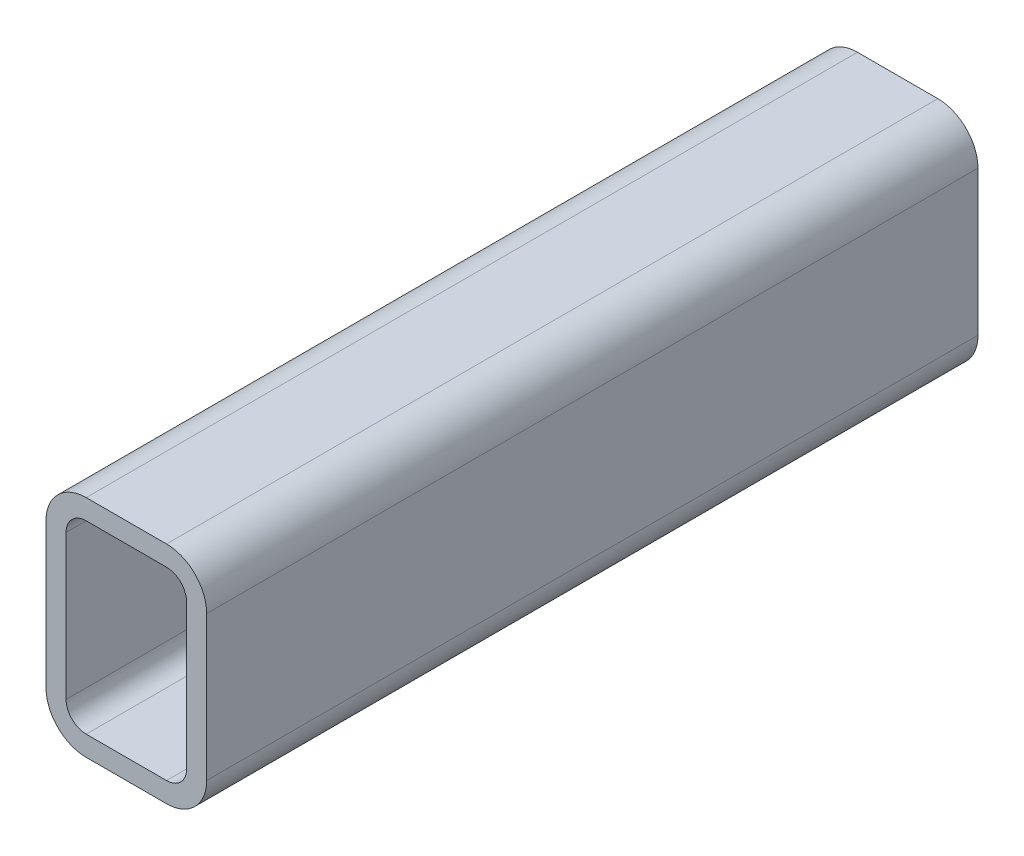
ISO-10303-21;
HEADER;
FILE_DESCRIPTION(('STEP AP214'),'2;1');
FILE_NAME('part.step','',(''),(''),'','','');
FILE_SCHEMA(('AUTOMOTIVE_DESIGN { 1 0 10303 214 1 1 1 1 }'));
ENDSEC;
DATA;
#1=APPLICATION_CONTEXT('core data for automotive mechanical design processes');
#2=APPLICATION_PROTOCOL_DEFINITION('international standard','automotive_design',2000,#1);
#3=PRODUCT_CONTEXT('',#1,'mechanical');
#4=PRODUCT('Part','Part','',(#3));
#5=PRODUCT_RELATED_PRODUCT_CATEGORY('part','',(#4));
#6=PRODUCT_DEFINITION_FORMATION('','',#4);
#7=PRODUCT_DEFINITION_CONTEXT('part definition',#1,'design');
#8=PRODUCT_DEFINITION('design','',#6,#7);
#9=PRODUCT_DEFINITION_SHAPE('','',#8);
#10=(LENGTH_UNIT() NAMED_UNIT(*) SI_UNIT(.MILLI.,.METRE.));
#11=(NAMED_UNIT(*) PLANE_ANGLE_UNIT() SI_UNIT($,.RADIAN.));
#12=(NAMED_UNIT(*) SI_UNIT($,.STERADIAN.) SOLID_ANGLE_UNIT());
#13=UNCERTAINTY_MEASURE_WITH_UNIT(LENGTH_MEASURE(1.E-05),#10,'distance_accuracy_value','');
#14=(GEOMETRIC_REPRESENTATION_CONTEXT(3) GLOBAL_UNCERTAINTY_ASSIGNED_CONTEXT((#13)) GLOBAL_UNIT_ASSIGNED_CONTEXT((#10,
#11,#12)) REPRESENTATION_CONTEXT('',''));
#15=CARTESIAN_POINT('',(0.,0.,0.));
#16=DIRECTION('',(0.,0.,1.));
#17=DIRECTION('',(1.,0.,0.));
#18=AXIS2_PLACEMENT_3D('',#15,#16,#17);
#19=CARTESIAN_POINT('',(18.7710851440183,73.8265103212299,304.8));
#20=DIRECTION('',(0.,0.,1.));
#21=DIRECTION('',(1.,0.,0.));
#22=AXIS2_PLACEMENT_3D('',#19,#20,#21);
#23=PLANE('',#22);
#24=CARTESIAN_POINT('',(18.7710851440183,73.8265103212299,304.8));
#25=DIRECTION('',(0.,0.,1.));
#26=DIRECTION('',(1.,0.,0.));
#27=AXIS2_PLACEMENT_3D('',#24,#25,#26);
#28=CIRCLE('',#27,15.875);
#29=CARTESIAN_POINT('',(18.7710851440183,89.7015103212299,304.8));
#30=VERTEX_POINT('',#29);
#31=CARTESIAN_POINT('',(2.89608514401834,73.8265103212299,304.8));
#32=VERTEX_POINT('',#31);
#33=EDGE_CURVE('E211',#30,#32,#28,.T.);
#34=ORIENTED_EDGE('',*,*,#33,.T.);
#35=DIRECTION('',(0.,-1.,0.));
#36=VECTOR('',#35,1.);
#37=CARTESIAN_POINT('',(2.89608514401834,16.6765103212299,304.8));
#38=LINE('',#37,#36);
#39=CARTESIAN_POINT('',(2.89608514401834,16.6765103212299,304.8));
#40=VERTEX_POINT('',#39);
#41=EDGE_CURVE('E214',#32,#40,#38,.T.);
#42=ORIENTED_EDGE('',*,*,#41,.T.);
#43=CARTESIAN_POINT('',(18.7710851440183,16.6765103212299,304.8));
#44=DIRECTION('',(0.,0.,1.));
#45=DIRECTION('',(1.,0.,0.));
#46=AXIS2_PLACEMENT_3D('',#43,#44,#45);
#47=CIRCLE('',#46,15.875);
#48=CARTESIAN_POINT('',(18.7710851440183,0.801510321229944,304.8));
#49=VERTEX_POINT('',#48);
#50=EDGE_CURVE('E217',#40,#49,#47,.T.);
#51=ORIENTED_EDGE('',*,*,#50,.T.);
#52=DIRECTION('',(1.,0.,0.));
#53=VECTOR('',#52,1.);
#54=CARTESIAN_POINT('',(50.5210851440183,0.801510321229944,304.8));
#55=LINE('',#54,#53);
#56=CARTESIAN_POINT('',(50.5210851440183,0.80151032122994,304.8));
#57=VERTEX_POINT('',#56);
#58=EDGE_CURVE('E219',#49,#57,#55,.T.);
#59=ORIENTED_EDGE('',*,*,#58,.T.);
#60=CARTESIAN_POINT('',(50.5210851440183,16.6765103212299,304.8));
#61=DIRECTION('',(0.,0.,1.));
#62=DIRECTION('',(1.,0.,0.));
#63=AXIS2_PLACEMENT_3D('',#60,#61,#62);
#64=CIRCLE('',#63,15.875);
#65=CARTESIAN_POINT('',(66.3960851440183,16.6765103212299,304.8));
#66=VERTEX_POINT('',#65);
#67=EDGE_CURVE('E221',#57,#66,#64,.T.);
#68=ORIENTED_EDGE('',*,*,#67,.T.);
#69=DIRECTION('',(0.,1.,0.));
#70=VECTOR('',#69,1.);
#71=CARTESIAN_POINT('',(66.3960851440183,73.8265103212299,304.8));
#72=LINE('',#71,#70);
#73=CARTESIAN_POINT('',(66.3960851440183,73.8265103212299,304.8));
#74=VERTEX_POINT('',#73);
#75=EDGE_CURVE('E223',#66,#74,#72,.T.);
#76=ORIENTED_EDGE('',*,*,#75,.T.);
#77=CARTESIAN_POINT('',(50.5210851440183,73.8265103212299,304.8));
#78=DIRECTION('',(0.,0.,1.));
#79=DIRECTION('',(1.,0.,0.));
#80=AXIS2_PLACEMENT_3D('',#77,#78,#79);
#81=CIRCLE('',#80,15.875);
#82=CARTESIAN_POINT('',(50.5210851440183,89.7015103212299,304.8));
#83=VERTEX_POINT('',#82);
#84=EDGE_CURVE('E225',#74,#83,#81,.T.);
#85=ORIENTED_EDGE('',*,*,#84,.T.);
#86=DIRECTION('',(-1.,0.,0.));
#87=VECTOR('',#86,1.);
#88=CARTESIAN_POINT('',(18.7710851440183,89.7015103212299,304.8));
#89=LINE('',#88,#87);
#90=EDGE_CURVE('E227',#83,#30,#89,.T.);
#91=ORIENTED_EDGE('',*,*,#90,.T.);
#92=EDGE_LOOP('',(#34,#42,#51,#59,#68,#76,#85,#91));
#93=FACE_BOUND('',#92,.T.);
#94=DIRECTION('',(0.,-1.,0.));
#95=VECTOR('',#94,1.);
#96=CARTESIAN_POINT('',(10.8335851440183,16.6765103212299,304.8));
#97=LINE('',#96,#95);
#98=CARTESIAN_POINT('',(10.8335851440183,73.8265103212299,304.8));
#99=VERTEX_POINT('',#98);
#100=CARTESIAN_POINT('',(10.8335851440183,16.6765103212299,304.8));
#101=VERTEX_POINT('',#100);
#102=EDGE_CURVE('E154',#99,#101,#97,.T.);
#103=ORIENTED_EDGE('',*,*,#102,.F.);
#104=CARTESIAN_POINT('',(18.7710851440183,73.8265103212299,304.8));
#105=DIRECTION('',(0.,0.,1.));
#106=DIRECTION('',(1.,0.,0.));
#107=AXIS2_PLACEMENT_3D('',#104,#105,#106);
#108=CIRCLE('',#107,7.9375);
#109=CARTESIAN_POINT('',(18.7710851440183,81.7640103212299,304.8));
#110=VERTEX_POINT('',#109);
#111=EDGE_CURVE('E146',#110,#99,#108,.T.);
#112=ORIENTED_EDGE('',*,*,#111,.F.);
#113=DIRECTION('',(-1.,0.,0.));
#114=VECTOR('',#113,1.);
#115=CARTESIAN_POINT('',(18.7710851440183,81.7640103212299,304.8));
#116=LINE('',#115,#114);
#117=CARTESIAN_POINT('',(50.5210851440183,81.7640103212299,304.8));
#118=VERTEX_POINT('',#117);
#119=EDGE_CURVE('E179',#118,#110,#116,.T.);
#120=ORIENTED_EDGE('',*,*,#119,.F.);
#121=CARTESIAN_POINT('',(50.5210851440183,73.8265103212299,304.8));
#122=DIRECTION('',(0.,0.,1.));
#123=DIRECTION('',(1.,0.,0.));
#124=AXIS2_PLACEMENT_3D('',#121,#122,#123);
#125=CIRCLE('',#124,7.9375);
#126=CARTESIAN_POINT('',(58.4585851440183,73.8265103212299,304.8));
#127=VERTEX_POINT('',#126);
#128=EDGE_CURVE('E177',#127,#118,#125,.T.);
#129=ORIENTED_EDGE('',*,*,#128,.F.);
#130=DIRECTION('',(0.,1.,0.));
#131=VECTOR('',#130,1.);
#132=CARTESIAN_POINT('',(58.4585851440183,73.8265103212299,304.8));
#133=LINE('',#132,#131);
#134=CARTESIAN_POINT('',(58.4585851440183,16.6765103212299,304.8));
#135=VERTEX_POINT('',#134);
#136=EDGE_CURVE('E175',#135,#127,#133,.T.);
#137=ORIENTED_EDGE('',*,*,#136,.F.);
#138=CARTESIAN_POINT('',(50.5210851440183,16.6765103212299,304.8));
#139=DIRECTION('',(0.,0.,1.));
#140=DIRECTION('',(1.,0.,0.));
#141=AXIS2_PLACEMENT_3D('',#138,#139,#140);
#142=CIRCLE('',#141,7.93750000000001);
#143=CARTESIAN_POINT('',(50.5210851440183,8.73901032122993,304.8));
#144=VERTEX_POINT('',#143);
#145=EDGE_CURVE('E173',#144,#135,#142,.T.);
#146=ORIENTED_EDGE('',*,*,#145,.F.);
#147=DIRECTION('',(1.,0.,0.));
#148=VECTOR('',#147,1.);
#149=CARTESIAN_POINT('',(50.5210851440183,8.73901032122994,304.8));
#150=LINE('',#149,#148);
#151=CARTESIAN_POINT('',(18.7710851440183,8.73901032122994,304.8));
#152=VERTEX_POINT('',#151);
#153=EDGE_CURVE('E169',#152,#144,#150,.T.);
#154=ORIENTED_EDGE('',*,*,#153,.F.);
#155=CARTESIAN_POINT('',(18.7710851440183,16.6765103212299,304.8));
#156=DIRECTION('',(0.,0.,1.));
#157=DIRECTION('',(1.,0.,0.));
#158=AXIS2_PLACEMENT_3D('',#155,#156,#157);
#159=CIRCLE('',#158,7.9375);
#160=EDGE_CURVE('E167',#101,#152,#159,.T.);
#161=ORIENTED_EDGE('',*,*,#160,.F.);
#162=EDGE_LOOP('',(#103,#112,#120,#129,#137,#146,#154,#161));
#163=FACE_BOUND('',#162,.T.);
#164=ADVANCED_FACE('F33',(#93,#163),#23,.T.);
#165=CARTESIAN_POINT('',(18.7710851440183,73.8265103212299,0.));
#166=DIRECTION('',(0.,0.,1.));
#167=DIRECTION('',(1.,0.,0.));
#168=AXIS2_PLACEMENT_3D('',#165,#166,#167);
#169=PLANE('',#168);
#170=CARTESIAN_POINT('',(18.7710851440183,73.8265103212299,0.));
#171=DIRECTION('',(0.,0.,1.));
#172=DIRECTION('',(1.,0.,0.));
#173=AXIS2_PLACEMENT_3D('',#170,#171,#172);
#174=CIRCLE('',#173,15.875);
#175=CARTESIAN_POINT('',(18.7710851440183,89.7015103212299,0.));
#176=VERTEX_POINT('',#175);
#177=CARTESIAN_POINT('',(2.89608514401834,73.8265103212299,0.));
#178=VERTEX_POINT('',#177);
#179=EDGE_CURVE('E162',#176,#178,#174,.T.);
#180=ORIENTED_EDGE('',*,*,#179,.F.);
#181=DIRECTION('',(-1.,0.,0.));
#182=VECTOR('',#181,1.);
#183=CARTESIAN_POINT('',(18.7710851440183,89.7015103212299,0.));
#184=LINE('',#183,#182);
#185=CARTESIAN_POINT('',(50.5210851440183,89.7015103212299,0.));
#186=VERTEX_POINT('',#185);
#187=EDGE_CURVE('E215',#186,#176,#184,.T.);
#188=ORIENTED_EDGE('',*,*,#187,.F.);
#189=CARTESIAN_POINT('',(50.5210851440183,73.8265103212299,0.));
#190=DIRECTION('',(0.,0.,1.));
#191=DIRECTION('',(1.,0.,0.));
#192=AXIS2_PLACEMENT_3D('',#189,#190,#191);
#193=CIRCLE('',#192,15.875);
#194=CARTESIAN_POINT('',(66.3960851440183,73.8265103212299,0.));
#195=VERTEX_POINT('',#194);
#196=EDGE_CURVE('E242',#195,#186,#193,.T.);
#197=ORIENTED_EDGE('',*,*,#196,.F.);
#198=DIRECTION('',(0.,1.,0.));
#199=VECTOR('',#198,1.);
#200=CARTESIAN_POINT('',(66.3960851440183,73.8265103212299,0.));
#201=LINE('',#200,#199);
#202=CARTESIAN_POINT('',(66.3960851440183,16.6765103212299,0.));
#203=VERTEX_POINT('',#202);
#204=EDGE_CURVE('E240',#203,#195,#201,.T.);
#205=ORIENTED_EDGE('',*,*,#204,.F.);
#206=CARTESIAN_POINT('',(50.5210851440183,16.6765103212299,0.));
#207=DIRECTION('',(0.,0.,1.));
#208=DIRECTION('',(1.,0.,0.));
#209=AXIS2_PLACEMENT_3D('',#206,#207,#208);
#210=CIRCLE('',#209,15.875);
#211=CARTESIAN_POINT('',(50.5210851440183,0.80151032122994,0.));
#212=VERTEX_POINT('',#211);
#213=EDGE_CURVE('E238',#212,#203,#210,.T.);
#214=ORIENTED_EDGE('',*,*,#213,.F.);
#215=DIRECTION('',(1.,0.,0.));
#216=VECTOR('',#215,1.);
#217=CARTESIAN_POINT('',(50.5210851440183,0.801510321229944,0.));
#218=LINE('',#217,#216);
#219=CARTESIAN_POINT('',(18.7710851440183,0.801510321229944,0.));
#220=VERTEX_POINT('',#219);
#221=EDGE_CURVE('E236',#220,#212,#218,.T.);
#222=ORIENTED_EDGE('',*,*,#221,.F.);
#223=CARTESIAN_POINT('',(18.7710851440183,16.6765103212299,0.));
#224=DIRECTION('',(0.,0.,1.));
#225=DIRECTION('',(1.,0.,0.));
#226=AXIS2_PLACEMENT_3D('',#223,#224,#225);
#227=CIRCLE('',#226,15.875);
#228=CARTESIAN_POINT('',(2.89608514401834,16.6765103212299,0.));
#229=VERTEX_POINT('',#228);
#230=EDGE_CURVE('E234',#229,#220,#227,.T.);
#231=ORIENTED_EDGE('',*,*,#230,.F.);
#232=DIRECTION('',(0.,-1.,0.));
#233=VECTOR('',#232,1.);
#234=CARTESIAN_POINT('',(2.89608514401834,16.6765103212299,0.));
#235=LINE('',#234,#233);
#236=EDGE_CURVE('E232',#178,#229,#235,.T.);
#237=ORIENTED_EDGE('',*,*,#236,.F.);
#238=EDGE_LOOP('',(#180,#188,#197,#205,#214,#222,#231,#237));
#239=FACE_BOUND('',#238,.T.);
#240=CARTESIAN_POINT('',(18.7710851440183,73.8265103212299,0.));
#241=DIRECTION('',(0.,0.,1.));
#242=DIRECTION('',(1.,0.,0.));
#243=AXIS2_PLACEMENT_3D('',#240,#241,#242);
#244=CIRCLE('',#243,7.9375);
#245=CARTESIAN_POINT('',(18.7710851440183,81.7640103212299,0.));
#246=VERTEX_POINT('',#245);
#247=CARTESIAN_POINT('',(10.8335851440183,73.8265103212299,0.));
#248=VERTEX_POINT('',#247);
#249=EDGE_CURVE('E56',#246,#248,#244,.T.);
#250=ORIENTED_EDGE('',*,*,#249,.T.);
#251=DIRECTION('',(0.,-1.,0.));
#252=VECTOR('',#251,1.);
#253=CARTESIAN_POINT('',(10.8335851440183,16.6765103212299,0.));
#254=LINE('',#253,#252);
#255=CARTESIAN_POINT('',(10.8335851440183,16.6765103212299,0.));
#256=VERTEX_POINT('',#255);
#257=EDGE_CURVE('E161',#248,#256,#254,.T.);
#258=ORIENTED_EDGE('',*,*,#257,.T.);
#259=CARTESIAN_POINT('',(18.7710851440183,16.6765103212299,0.));
#260=DIRECTION('',(0.,0.,1.));
#261=DIRECTION('',(1.,0.,0.));
#262=AXIS2_PLACEMENT_3D('',#259,#260,#261);
#263=CIRCLE('',#262,7.9375);
#264=CARTESIAN_POINT('',(18.7710851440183,8.73901032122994,0.));
#265=VERTEX_POINT('',#264);
#266=EDGE_CURVE('E183',#256,#265,#263,.T.);
#267=ORIENTED_EDGE('',*,*,#266,.T.);
#268=DIRECTION('',(1.,0.,0.));
#269=VECTOR('',#268,1.);
#270=CARTESIAN_POINT('',(50.5210851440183,8.73901032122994,0.));
#271=LINE('',#270,#269);
#272=CARTESIAN_POINT('',(50.5210851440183,8.73901032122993,0.));
#273=VERTEX_POINT('',#272);
#274=EDGE_CURVE('E186',#265,#273,#271,.T.);
#275=ORIENTED_EDGE('',*,*,#274,.T.);
#276=CARTESIAN_POINT('',(50.5210851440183,16.6765103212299,0.));
#277=DIRECTION('',(0.,0.,1.));
#278=DIRECTION('',(1.,0.,0.));
#279=AXIS2_PLACEMENT_3D('',#276,#277,#278);
#280=CIRCLE('',#279,7.93750000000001);
#281=CARTESIAN_POINT('',(58.4585851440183,16.6765103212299,0.));
#282=VERTEX_POINT('',#281);
#283=EDGE_CURVE('E189',#273,#282,#280,.T.);
#284=ORIENTED_EDGE('',*,*,#283,.T.);
#285=DIRECTION('',(0.,1.,0.));
#286=VECTOR('',#285,1.);
#287=CARTESIAN_POINT('',(58.4585851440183,73.8265103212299,0.));
#288=LINE('',#287,#286);
#289=CARTESIAN_POINT('',(58.4585851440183,73.8265103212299,0.));
#290=VERTEX_POINT('',#289);
#291=EDGE_CURVE('E192',#282,#290,#288,.T.);
#292=ORIENTED_EDGE('',*,*,#291,.T.);
#293=CARTESIAN_POINT('',(50.5210851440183,73.8265103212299,0.));
#294=DIRECTION('',(0.,0.,1.));
#295=DIRECTION('',(1.,0.,0.));
#296=AXIS2_PLACEMENT_3D('',#293,#294,#295);
#297=CIRCLE('',#296,7.9375);
#298=CARTESIAN_POINT('',(50.5210851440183,81.7640103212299,0.));
#299=VERTEX_POINT('',#298);
#300=EDGE_CURVE('E195',#290,#299,#297,.T.);
#301=ORIENTED_EDGE('',*,*,#300,.T.);
#302=DIRECTION('',(-1.,0.,0.));
#303=VECTOR('',#302,1.);
#304=CARTESIAN_POINT('',(18.7710851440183,81.7640103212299,0.));
#305=LINE('',#304,#303);
#306=EDGE_CURVE('E155',#299,#246,#305,.T.);
#307=ORIENTED_EDGE('',*,*,#306,.T.);
#308=EDGE_LOOP('',(#250,#258,#267,#275,#284,#292,#301,#307));
#309=FACE_BOUND('',#308,.T.);
#310=ADVANCED_FACE('F272',(#239,#309),#169,.F.);
#311=CARTESIAN_POINT('',(18.7710851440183,73.8265103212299,304.8));
#312=DIRECTION('',(0.,0.,-1.));
#313=DIRECTION('',(-1.,0.,0.));
#314=AXIS2_PLACEMENT_3D('',#311,#312,#313);
#315=CYLINDRICAL_SURFACE('',#314,15.875);
#316=ORIENTED_EDGE('',*,*,#179,.T.);
#317=DIRECTION('',(0.,0.,-1.));
#318=VECTOR('',#317,1.);
#319=CARTESIAN_POINT('',(2.89608514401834,73.8265103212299,304.8));
#320=LINE('',#319,#318);
#321=EDGE_CURVE('E11',#32,#178,#320,.T.);
#322=ORIENTED_EDGE('',*,*,#321,.F.);
#323=ORIENTED_EDGE('',*,*,#33,.F.);
#324=DIRECTION('',(0.,0.,-1.));
#325=VECTOR('',#324,1.);
#326=CARTESIAN_POINT('',(18.7710851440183,89.7015103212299,304.8));
#327=LINE('',#326,#325);
#328=EDGE_CURVE('E229',#30,#176,#327,.T.);
#329=ORIENTED_EDGE('',*,*,#328,.T.);
#330=EDGE_LOOP('',(#316,#322,#323,#329));
#331=FACE_BOUND('',#330,.T.);
#332=ADVANCED_FACE('F35',(#331),#315,.T.);
#333=CARTESIAN_POINT('',(2.89608514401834,16.6765103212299,304.8));
#334=DIRECTION('',(1.,0.,0.));
#335=DIRECTION('',(0.,0.,-1.));
#336=AXIS2_PLACEMENT_3D('',#333,#334,#335);
#337=PLANE('',#336);
#338=ORIENTED_EDGE('',*,*,#236,.T.);
#339=DIRECTION('',(0.,0.,-1.));
#340=VECTOR('',#339,1.);
#341=CARTESIAN_POINT('',(2.89608514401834,16.6765103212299,304.8));
#342=LINE('',#341,#340);
#343=EDGE_CURVE('E41',#40,#229,#342,.T.);
#344=ORIENTED_EDGE('',*,*,#343,.F.);
#345=ORIENTED_EDGE('',*,*,#41,.F.);
#346=ORIENTED_EDGE('',*,*,#321,.T.);
#347=EDGE_LOOP('',(#338,#344,#345,#346));
#348=FACE_BOUND('',#347,.T.);
#349=ADVANCED_FACE('F289',(#348),#337,.F.);
#350=CARTESIAN_POINT('',(18.7710851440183,16.6765103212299,304.8));
#351=DIRECTION('',(0.,0.,-1.));
#352=DIRECTION('',(-1.,0.,0.));
#353=AXIS2_PLACEMENT_3D('',#350,#351,#352);
#354=CYLINDRICAL_SURFACE('',#353,15.875);
#355=ORIENTED_EDGE('',*,*,#230,.T.);
#356=DIRECTION('',(0.,0.,-1.));
#357=VECTOR('',#356,1.);
#358=CARTESIAN_POINT('',(18.7710851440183,0.801510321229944,304.8));
#359=LINE('',#358,#357);
#360=EDGE_CURVE('E259',#49,#220,#359,.T.);
#361=ORIENTED_EDGE('',*,*,#360,.F.);
#362=ORIENTED_EDGE('',*,*,#50,.F.);
#363=ORIENTED_EDGE('',*,*,#343,.T.);
#364=EDGE_LOOP('',(#355,#361,#362,#363));
#365=FACE_BOUND('',#364,.T.);
#366=ADVANCED_FACE('F266',(#365),#354,.T.);
#367=CARTESIAN_POINT('',(50.5210851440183,0.801510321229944,304.8));
#368=DIRECTION('',(0.,1.,0.));
#369=DIRECTION('',(0.,0.,1.));
#370=AXIS2_PLACEMENT_3D('',#367,#368,#369);
#371=PLANE('',#370);
#372=ORIENTED_EDGE('',*,*,#221,.T.);
#373=DIRECTION('',(0.,0.,-1.));
#374=VECTOR('',#373,1.);
#375=CARTESIAN_POINT('',(50.5210851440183,0.80151032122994,304.8));
#376=LINE('',#375,#374);
#377=EDGE_CURVE('E256',#57,#212,#376,.T.);
#378=ORIENTED_EDGE('',*,*,#377,.F.);
#379=ORIENTED_EDGE('',*,*,#58,.F.);
#380=ORIENTED_EDGE('',*,*,#360,.T.);
#381=EDGE_LOOP('',(#372,#378,#379,#380));
#382=FACE_BOUND('',#381,.T.);
#383=ADVANCED_FACE('F278',(#382),#371,.F.);
#384=CARTESIAN_POINT('',(50.5210851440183,16.6765103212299,304.8));
#385=DIRECTION('',(0.,0.,-1.));
#386=DIRECTION('',(-1.,0.,0.));
#387=AXIS2_PLACEMENT_3D('',#384,#385,#386);
#388=CYLINDRICAL_SURFACE('',#387,15.875);
#389=ORIENTED_EDGE('',*,*,#213,.T.);
#390=DIRECTION('',(0.,0.,-1.));
#391=VECTOR('',#390,1.);
#392=CARTESIAN_POINT('',(66.3960851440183,16.6765103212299,304.8));
#393=LINE('',#392,#391);
#394=EDGE_CURVE('E253',#66,#203,#393,.T.);
#395=ORIENTED_EDGE('',*,*,#394,.F.);
#396=ORIENTED_EDGE('',*,*,#67,.F.);
#397=ORIENTED_EDGE('',*,*,#377,.T.);
#398=EDGE_LOOP('',(#389,#395,#396,#397));
#399=FACE_BOUND('',#398,.T.);
#400=ADVANCED_FACE('F282',(#399),#388,.T.);
#401=CARTESIAN_POINT('',(66.3960851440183,73.8265103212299,304.8));
#402=DIRECTION('',(-1.,0.,0.));
#403=DIRECTION('',(0.,0.,1.));
#404=AXIS2_PLACEMENT_3D('',#401,#402,#403);
#405=PLANE('',#404);
#406=ORIENTED_EDGE('',*,*,#204,.T.);
#407=DIRECTION('',(0.,0.,-1.));
#408=VECTOR('',#407,1.);
#409=CARTESIAN_POINT('',(66.3960851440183,73.8265103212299,304.8));
#410=LINE('',#409,#408);
#411=EDGE_CURVE('E250',#74,#195,#410,.T.);
#412=ORIENTED_EDGE('',*,*,#411,.F.);
#413=ORIENTED_EDGE('',*,*,#75,.F.);
#414=ORIENTED_EDGE('',*,*,#394,.T.);
#415=EDGE_LOOP('',(#406,#412,#413,#414));
#416=FACE_BOUND('',#415,.T.);
#417=ADVANCED_FACE('F302',(#416),#405,.F.);
#418=CARTESIAN_POINT('',(50.5210851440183,73.8265103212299,304.8));
#419=DIRECTION('',(0.,0.,-1.));
#420=DIRECTION('',(-1.,0.,0.));
#421=AXIS2_PLACEMENT_3D('',#418,#419,#420);
#422=CYLINDRICAL_SURFACE('',#421,15.875);
#423=ORIENTED_EDGE('',*,*,#196,.T.);
#424=DIRECTION('',(0.,0.,-1.));
#425=VECTOR('',#424,1.);
#426=CARTESIAN_POINT('',(50.5210851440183,89.7015103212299,304.8));
#427=LINE('',#426,#425);
#428=EDGE_CURVE('E247',#83,#186,#427,.T.);
#429=ORIENTED_EDGE('',*,*,#428,.F.);
#430=ORIENTED_EDGE('',*,*,#84,.F.);
#431=ORIENTED_EDGE('',*,*,#411,.T.);
#432=EDGE_LOOP('',(#423,#429,#430,#431));
#433=FACE_BOUND('',#432,.T.);
#434=ADVANCED_FACE('F300',(#433),#422,.T.);
#435=CARTESIAN_POINT('',(18.7710851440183,89.7015103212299,304.8));
#436=DIRECTION('',(0.,-1.,0.));
#437=DIRECTION('',(0.,0.,-1.));
#438=AXIS2_PLACEMENT_3D('',#435,#436,#437);
#439=PLANE('',#438);
#440=ORIENTED_EDGE('',*,*,#187,.T.);
#441=ORIENTED_EDGE('',*,*,#328,.F.);
#442=ORIENTED_EDGE('',*,*,#90,.F.);
#443=ORIENTED_EDGE('',*,*,#428,.T.);
#444=EDGE_LOOP('',(#440,#441,#442,#443));
#445=FACE_BOUND('',#444,.T.);
#446=ADVANCED_FACE('F295',(#445),#439,.F.);
#447=CARTESIAN_POINT('',(18.7710851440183,73.8265103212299,304.8));
#448=DIRECTION('',(0.,0.,-1.));
#449=DIRECTION('',(-1.,0.,0.));
#450=AXIS2_PLACEMENT_3D('',#447,#448,#449);
#451=CYLINDRICAL_SURFACE('',#450,7.9375);
#452=ORIENTED_EDGE('',*,*,#249,.F.);
#453=DIRECTION('',(0.,0.,-1.));
#454=VECTOR('',#453,1.);
#455=CARTESIAN_POINT('',(18.7710851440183,81.7640103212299,304.8));
#456=LINE('',#455,#454);
#457=EDGE_CURVE('E150',#110,#246,#456,.T.);
#458=ORIENTED_EDGE('',*,*,#457,.F.);
#459=ORIENTED_EDGE('',*,*,#111,.T.);
#460=DIRECTION('',(0.,0.,-1.));
#461=VECTOR('',#460,1.);
#462=CARTESIAN_POINT('',(10.8335851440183,73.8265103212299,304.8));
#463=LINE('',#462,#461);
#464=EDGE_CURVE('E149',#99,#248,#463,.T.);
#465=ORIENTED_EDGE('',*,*,#464,.T.);
#466=EDGE_LOOP('',(#452,#458,#459,#465));
#467=FACE_BOUND('',#466,.T.);
#468=ADVANCED_FACE('F148',(#467),#451,.F.);
#469=CARTESIAN_POINT('',(10.8335851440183,16.6765103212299,304.8));
#470=DIRECTION('',(1.,0.,0.));
#471=DIRECTION('',(0.,0.,-1.));
#472=AXIS2_PLACEMENT_3D('',#469,#470,#471);
#473=PLANE('',#472);
#474=ORIENTED_EDGE('',*,*,#257,.F.);
#475=ORIENTED_EDGE('',*,*,#464,.F.);
#476=ORIENTED_EDGE('',*,*,#102,.T.);
#477=DIRECTION('',(0.,0.,-1.));
#478=VECTOR('',#477,1.);
#479=CARTESIAN_POINT('',(10.8335851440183,16.6765103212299,304.8));
#480=LINE('',#479,#478);
#481=EDGE_CURVE('E163',#101,#256,#480,.T.);
#482=ORIENTED_EDGE('',*,*,#481,.T.);
#483=EDGE_LOOP('',(#474,#475,#476,#482));
#484=FACE_BOUND('',#483,.T.);
#485=ADVANCED_FACE('F158',(#484),#473,.T.);
#486=CARTESIAN_POINT('',(18.7710851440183,16.6765103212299,304.8));
#487=DIRECTION('',(0.,0.,-1.));
#488=DIRECTION('',(-1.,0.,0.));
#489=AXIS2_PLACEMENT_3D('',#486,#487,#488);
#490=CYLINDRICAL_SURFACE('',#489,7.9375);
#491=ORIENTED_EDGE('',*,*,#266,.F.);
#492=ORIENTED_EDGE('',*,*,#481,.F.);
#493=ORIENTED_EDGE('',*,*,#160,.T.);
#494=DIRECTION('',(0.,0.,-1.));
#495=VECTOR('',#494,1.);
#496=CARTESIAN_POINT('',(18.7710851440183,8.73901032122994,304.8));
#497=LINE('',#496,#495);
#498=EDGE_CURVE('E208',#152,#265,#497,.T.);
#499=ORIENTED_EDGE('',*,*,#498,.T.);
#500=EDGE_LOOP('',(#491,#492,#493,#499));
#501=FACE_BOUND('',#500,.T.);
#502=ADVANCED_FACE('F327',(#501),#490,.F.);
#503=CARTESIAN_POINT('',(50.5210851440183,8.73901032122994,304.8));
#504=DIRECTION('',(0.,1.,0.));
#505=DIRECTION('',(0.,0.,1.));
#506=AXIS2_PLACEMENT_3D('',#503,#504,#505);
#507=PLANE('',#506);
#508=ORIENTED_EDGE('',*,*,#274,.F.);
#509=ORIENTED_EDGE('',*,*,#498,.F.);
#510=ORIENTED_EDGE('',*,*,#153,.T.);
#511=DIRECTION('',(0.,0.,-1.));
#512=VECTOR('',#511,1.);
#513=CARTESIAN_POINT('',(50.5210851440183,8.73901032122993,304.8));
#514=LINE('',#513,#512);
#515=EDGE_CURVE('E206',#144,#273,#514,.T.);
#516=ORIENTED_EDGE('',*,*,#515,.T.);
#517=EDGE_LOOP('',(#508,#509,#510,#516));
#518=FACE_BOUND('',#517,.T.);
#519=ADVANCED_FACE('F331',(#518),#507,.T.);
#520=CARTESIAN_POINT('',(50.5210851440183,16.6765103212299,304.8));
#521=DIRECTION('',(0.,0.,-1.));
#522=DIRECTION('',(-1.,0.,0.));
#523=AXIS2_PLACEMENT_3D('',#520,#521,#522);
#524=CYLINDRICAL_SURFACE('',#523,7.93750000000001);
#525=ORIENTED_EDGE('',*,*,#283,.F.);
#526=ORIENTED_EDGE('',*,*,#515,.F.);
#527=ORIENTED_EDGE('',*,*,#145,.T.);
#528=DIRECTION('',(0.,0.,-1.));
#529=VECTOR('',#528,1.);
#530=CARTESIAN_POINT('',(58.4585851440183,16.6765103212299,304.8));
#531=LINE('',#530,#529);
#532=EDGE_CURVE('E204',#135,#282,#531,.T.);
#533=ORIENTED_EDGE('',*,*,#532,.T.);
#534=EDGE_LOOP('',(#525,#526,#527,#533));
#535=FACE_BOUND('',#534,.T.);
#536=ADVANCED_FACE('F337',(#535),#524,.F.);
#537=CARTESIAN_POINT('',(58.4585851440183,73.8265103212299,304.8));
#538=DIRECTION('',(-1.,0.,0.));
#539=DIRECTION('',(0.,0.,1.));
#540=AXIS2_PLACEMENT_3D('',#537,#538,#539);
#541=PLANE('',#540);
#542=ORIENTED_EDGE('',*,*,#291,.F.);
#543=ORIENTED_EDGE('',*,*,#532,.F.);
#544=ORIENTED_EDGE('',*,*,#136,.T.);
#545=DIRECTION('',(0.,0.,-1.));
#546=VECTOR('',#545,1.);
#547=CARTESIAN_POINT('',(58.4585851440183,73.8265103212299,304.8));
#548=LINE('',#547,#546);
#549=EDGE_CURVE('E202',#127,#290,#548,.T.);
#550=ORIENTED_EDGE('',*,*,#549,.T.);
#551=EDGE_LOOP('',(#542,#543,#544,#550));
#552=FACE_BOUND('',#551,.T.);
#553=ADVANCED_FACE('F341',(#552),#541,.T.);
#554=CARTESIAN_POINT('',(50.5210851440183,73.8265103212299,304.8));
#555=DIRECTION('',(0.,0.,-1.));
#556=DIRECTION('',(-1.,0.,0.));
#557=AXIS2_PLACEMENT_3D('',#554,#555,#556);
#558=CYLINDRICAL_SURFACE('',#557,7.9375);
#559=ORIENTED_EDGE('',*,*,#300,.F.);
#560=ORIENTED_EDGE('',*,*,#549,.F.);
#561=ORIENTED_EDGE('',*,*,#128,.T.);
#562=DIRECTION('',(0.,0.,-1.));
#563=VECTOR('',#562,1.);
#564=CARTESIAN_POINT('',(50.5210851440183,81.7640103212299,304.8));
#565=LINE('',#564,#563);
#566=EDGE_CURVE('E48',#118,#299,#565,.T.);
#567=ORIENTED_EDGE('',*,*,#566,.T.);
#568=EDGE_LOOP('',(#559,#560,#561,#567));
#569=FACE_BOUND('',#568,.T.);
#570=ADVANCED_FACE('F345',(#569),#558,.F.);
#571=CARTESIAN_POINT('',(18.7710851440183,81.7640103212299,304.8));
#572=DIRECTION('',(0.,-1.,0.));
#573=DIRECTION('',(0.,0.,-1.));
#574=AXIS2_PLACEMENT_3D('',#571,#572,#573);
#575=PLANE('',#574);
#576=ORIENTED_EDGE('',*,*,#306,.F.);
#577=ORIENTED_EDGE('',*,*,#566,.F.);
#578=ORIENTED_EDGE('',*,*,#119,.T.);
#579=ORIENTED_EDGE('',*,*,#457,.T.);
#580=EDGE_LOOP('',(#576,#577,#578,#579));
#581=FACE_BOUND('',#580,.T.);
#582=ADVANCED_FACE('F349',(#581),#575,.T.);
#583=CLOSED_SHELL('',(#164,#310,#332,#349,#366,#383,#400,#417,#434,#446,#468,#485,#502,#519,
#536,#553,#570,#582));
#584=MANIFOLD_SOLID_BREP('B2',#583);
#585=ADVANCED_BREP_SHAPE_REPRESENTATION('',(#18,#584),#14);
#586=SHAPE_DEFINITION_REPRESENTATION(#9,#585);
ENDSEC;
END-ISO-10303-21;
